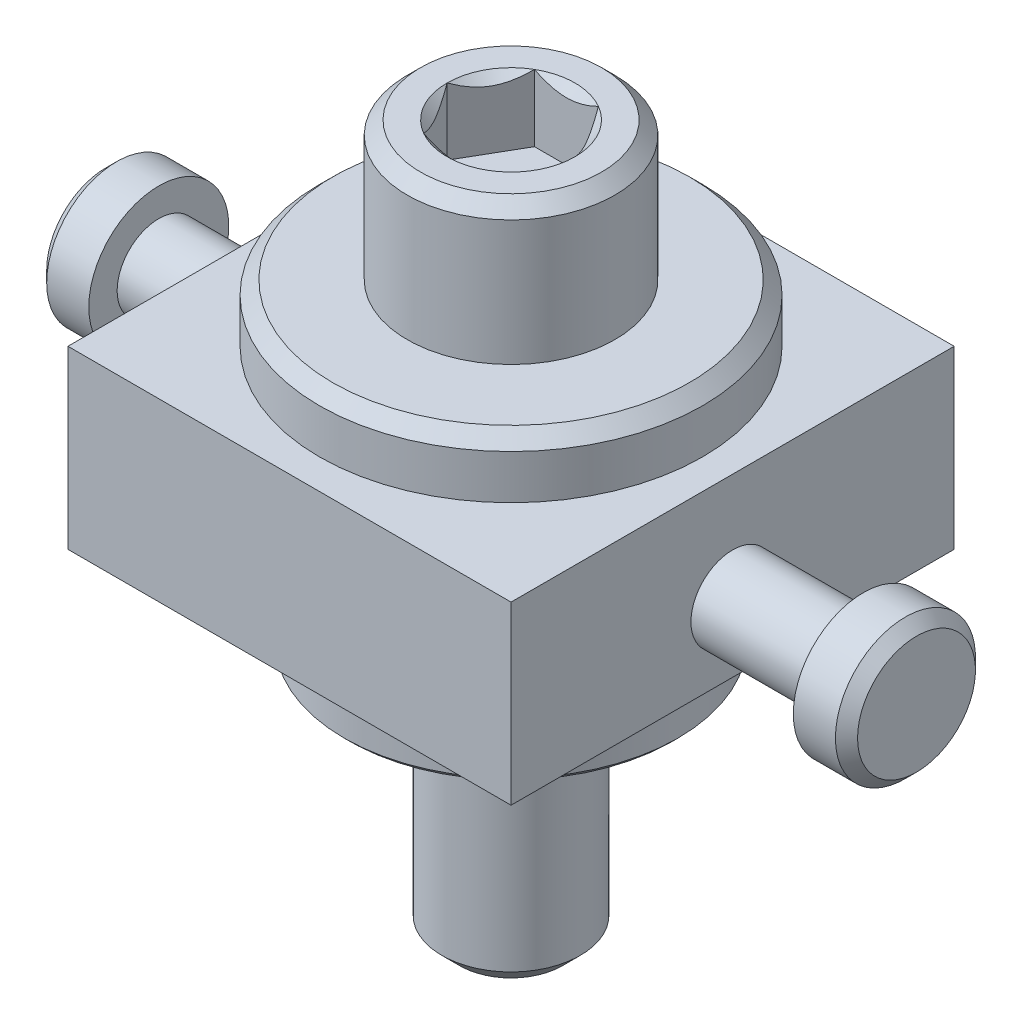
from build123d import *

# Parameters (mm, degrees)
SKETCH2_OUTSIDE_W   = 53.582
SKETCH2_OUTSIDE_H   = 53.582
SKETCH2_OUTSIDE_W_2 = 25.4
SKETCH2_OUTSIDE_H_2 = 25.4
CUT_EXTRUDE1_DEPTH  = 40.783700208
CUT_EXTRUDE2_DEPTH  = 3.8354


with BuildPart() as part:
    # Sketch1 → Base-Revolve (revolve)
    with BuildSketch(Plane.XY, mode=Mode.PRIVATE) as base_revolve_sk:
        Polygon((3.96875, 0), (9.25195, 0), (9.55675, 0.3048), (9.55675, 4.9022), (18.7452, 4.9022), (19.05, 5.207), (19.05, 14.6812), (18.7452, 14.986), (10.9855, 14.986), (10.9855, 17.526), (10.2235, 18.288), (5.953125, 18.288), (5.953125, 25.4635), (5.191125, 26.2255), (0, 26.2255), (0, -14.2875), (2.95275, -14.2875), (3.96875, -13.2715), align=None)
    revolve(base_revolve_sk.sketch.rotate(Axis((0, -14.2875, 0), (0, 1, 0)), 90), axis=Axis((0, -14.2875, 0), (0, 1, 0)))

    # Sketch2 outside → Cut-Extrude1 (cut, through all)
    with BuildSketch(Plane(origin=(0, 14.986, 0), x_dir=(-1, 0, 0), z_dir=(0, 1, 0))):
        Rectangle(SKETCH2_OUTSIDE_W, SKETCH2_OUTSIDE_H)
        Rectangle(SKETCH2_OUTSIDE_W_2, SKETCH2_OUTSIDE_H_2, mode=Mode.SUBTRACT)
    extrude(amount=-CUT_EXTRUDE1_DEPTH, mode=Mode.SUBTRACT)

    # Sketch3 → Cut-Extrude2 (cut)
    with BuildSketch(Plane(origin=(0, 26.2255, 0), x_dir=(-1, 0, 0), z_dir=(0, 1, 0))):
        Polygon((3.666174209, 0), (1.833087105, 3.175), (-1.833087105, 3.175), (-3.666174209, 0), (-1.833087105, -3.175), (1.833087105, -3.175), align=None)
    extrude(amount=-CUT_EXTRUDE2_DEPTH, mode=Mode.SUBTRACT)

    # Cut-Extrude3 cone 1 section (on through the dimple's axis) → Cut-Extrude3 (revolve, cut)
    with BuildSketch(Plane(origin=(0, 26.2255, 0), x_dir=(0, 0, 1), z_dir=(1, 0, 0))):
        Polygon((0, 0), (3.666174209, 0), (0, 3.666174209), align=None)
    revolve(axis=Axis((0, 26.2255, 0), (0, -1, 0)), mode=Mode.SUBTRACT)

    # Sketch6 → Boss-Revolve1 (revolve)
    with BuildSketch(Plane.XY, mode=Mode.PRIVATE) as boss_revolve1_sk:
        Polygon((23.241, 8.8392), (-23.241, 8.8392), (-23.241, 12.2174), (-22.606, 12.8524), (-20.193, 12.8524), (-20.193, 11.2268), (20.193, 11.2268), (20.193, 12.8524), (22.606, 12.8524), (23.241, 12.2174), align=None)
    revolve(boss_revolve1_sk.sketch.rotate(Axis((-23.241, 8.8392, 0), (1, 0, 0)), 90), axis=Axis((-23.241, 8.8392, 0), (1, 0, 0)))


solid = part.part
